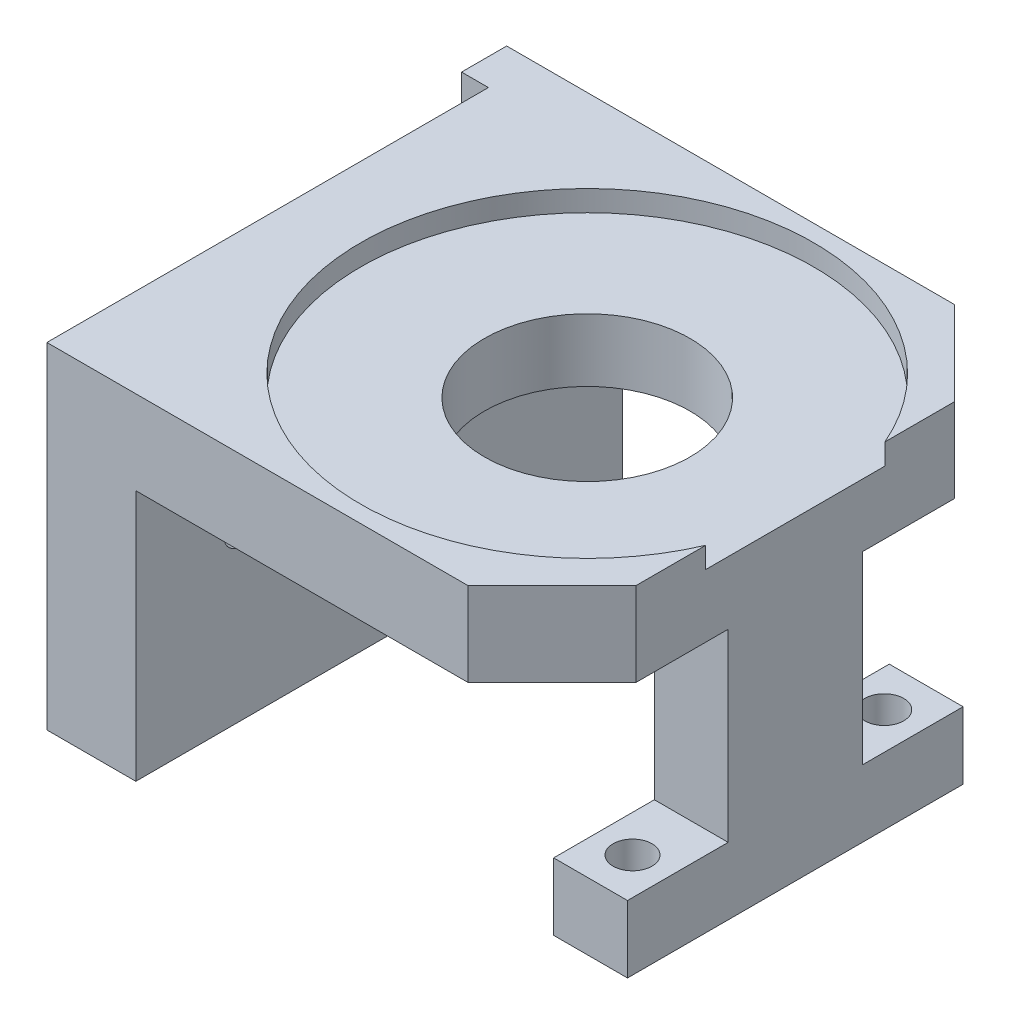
ISO-10303-21;
HEADER;
FILE_DESCRIPTION(('STEP AP214'),'2;1');
FILE_NAME('part.step','',(''),(''),'','','');
FILE_SCHEMA(('AUTOMOTIVE_DESIGN { 1 0 10303 214 1 1 1 1 }'));
ENDSEC;
DATA;
#1=APPLICATION_CONTEXT('core data for automotive mechanical design processes');
#2=APPLICATION_PROTOCOL_DEFINITION('international standard','automotive_design',2000,#1);
#3=PRODUCT_CONTEXT('',#1,'mechanical');
#4=PRODUCT('Part','Part','',(#3));
#5=PRODUCT_RELATED_PRODUCT_CATEGORY('part','',(#4));
#6=PRODUCT_DEFINITION_FORMATION('','',#4);
#7=PRODUCT_DEFINITION_CONTEXT('part definition',#1,'design');
#8=PRODUCT_DEFINITION('design','',#6,#7);
#9=PRODUCT_DEFINITION_SHAPE('','',#8);
#10=(LENGTH_UNIT() NAMED_UNIT(*) SI_UNIT(.MILLI.,.METRE.));
#11=(NAMED_UNIT(*) PLANE_ANGLE_UNIT() SI_UNIT($,.RADIAN.));
#12=(NAMED_UNIT(*) SI_UNIT($,.STERADIAN.) SOLID_ANGLE_UNIT());
#13=UNCERTAINTY_MEASURE_WITH_UNIT(LENGTH_MEASURE(1.E-05),#10,'distance_accuracy_value','');
#14=(GEOMETRIC_REPRESENTATION_CONTEXT(3) GLOBAL_UNCERTAINTY_ASSIGNED_CONTEXT((#13)) GLOBAL_UNIT_ASSIGNED_CONTEXT((#10,
#11,#12)) REPRESENTATION_CONTEXT('',''));
#15=CARTESIAN_POINT('',(0.,0.,0.));
#16=DIRECTION('',(0.,0.,1.));
#17=DIRECTION('',(1.,0.,0.));
#18=AXIS2_PLACEMENT_3D('',#15,#16,#17);
#19=CARTESIAN_POINT('',(0.,-6.35,0.));
#20=DIRECTION('',(0.,1.,0.));
#21=DIRECTION('',(0.,0.,1.));
#22=AXIS2_PLACEMENT_3D('',#19,#20,#21);
#23=CYLINDRICAL_SURFACE('',#22,7.77875);
#24=CARTESIAN_POINT('',(0.,-6.35,0.));
#25=DIRECTION('',(0.,1.,0.));
#26=DIRECTION('',(0.,0.,1.));
#27=AXIS2_PLACEMENT_3D('',#24,#25,#26);
#28=CIRCLE('',#27,7.77875);
#29=CARTESIAN_POINT('',(0.,-6.35,7.77875));
#30=VERTEX_POINT('',#29);
#31=EDGE_CURVE('E331',#30,#30,#28,.T.);
#32=ORIENTED_EDGE('',*,*,#31,.F.);
#33=EDGE_LOOP('',(#32));
#34=FACE_BOUND('',#33,.T.);
#35=CARTESIAN_POINT('',(0.,-1.5875,0.));
#36=DIRECTION('',(0.,1.,0.));
#37=DIRECTION('',(0.,0.,1.));
#38=AXIS2_PLACEMENT_3D('',#35,#36,#37);
#39=CIRCLE('',#38,7.77875);
#40=CARTESIAN_POINT('',(0.,-1.5875,7.77875));
#41=VERTEX_POINT('',#40);
#42=EDGE_CURVE('E48',#41,#41,#39,.F.);
#43=ORIENTED_EDGE('',*,*,#42,.F.);
#44=EDGE_LOOP('',(#43));
#45=FACE_BOUND('',#44,.T.);
#46=ADVANCED_FACE('F44',(#34,#45),#23,.F.);
#47=CARTESIAN_POINT('',(0.,-6.35,0.));
#48=DIRECTION('',(0.,1.,0.));
#49=DIRECTION('',(0.,0.,1.));
#50=AXIS2_PLACEMENT_3D('',#47,#48,#49);
#51=PLANE('',#50);
#52=ORIENTED_EDGE('',*,*,#31,.T.);
#53=EDGE_LOOP('',(#52));
#54=FACE_BOUND('',#53,.T.);
#55=DIRECTION('',(-1.,0.,0.));
#56=VECTOR('',#55,1.);
#57=CARTESIAN_POINT('',(-22.479,-6.35,-18.415));
#58=LINE('',#57,#56);
#59=CARTESIAN_POINT('',(9.39799999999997,-6.35,-18.415));
#60=VERTEX_POINT('',#59);
#61=CARTESIAN_POINT('',(-15.748,-6.35,-18.415));
#62=VERTEX_POINT('',#61);
#63=EDGE_CURVE('E257',#60,#62,#58,.T.);
#64=ORIENTED_EDGE('',*,*,#63,.F.);
#65=DIRECTION('',(-0.707106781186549,0.,-0.707106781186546));
#66=VECTOR('',#65,1.);
#67=CARTESIAN_POINT('',(15.748,-6.35,-12.065));
#68=LINE('',#67,#66);
#69=CARTESIAN_POINT('',(15.748,-6.35,-12.065));
#70=VERTEX_POINT('',#69);
#71=EDGE_CURVE('E54',#60,#70,#68,.F.);
#72=ORIENTED_EDGE('',*,*,#71,.T.);
#73=DIRECTION('',(0.,0.,-1.));
#74=VECTOR('',#73,1.);
#75=CARTESIAN_POINT('',(15.748,-6.35,-18.415));
#76=LINE('',#75,#74);
#77=CARTESIAN_POINT('',(15.748,-6.35,-5.08));
#78=VERTEX_POINT('',#77);
#79=EDGE_CURVE('E261',#78,#70,#76,.T.);
#80=ORIENTED_EDGE('',*,*,#79,.F.);
#81=DIRECTION('',(1.,0.,0.));
#82=VECTOR('',#81,1.);
#83=CARTESIAN_POINT('',(15.748,-6.35,-5.08));
#84=LINE('',#83,#82);
#85=CARTESIAN_POINT('',(10.16,-6.35,-5.08));
#86=VERTEX_POINT('',#85);
#87=EDGE_CURVE('E388',#86,#78,#84,.T.);
#88=ORIENTED_EDGE('',*,*,#87,.F.);
#89=DIRECTION('',(0.,0.,-1.));
#90=VECTOR('',#89,1.);
#91=CARTESIAN_POINT('',(10.16,-6.35,-5.08));
#92=LINE('',#91,#90);
#93=CARTESIAN_POINT('',(10.16,-6.35,5.08));
#94=VERTEX_POINT('',#93);
#95=EDGE_CURVE('E394',#94,#86,#92,.T.);
#96=ORIENTED_EDGE('',*,*,#95,.F.);
#97=DIRECTION('',(-1.,0.,0.));
#98=VECTOR('',#97,1.);
#99=CARTESIAN_POINT('',(15.748,-6.35,5.08));
#100=LINE('',#99,#98);
#101=CARTESIAN_POINT('',(15.748,-6.35,5.08));
#102=VERTEX_POINT('',#101);
#103=EDGE_CURVE('E383',#102,#94,#100,.T.);
#104=ORIENTED_EDGE('',*,*,#103,.F.);
#105=CARTESIAN_POINT('',(15.748,-6.35,12.065));
#106=VERTEX_POINT('',#105);
#107=EDGE_CURVE('E269',#106,#102,#76,.T.);
#108=ORIENTED_EDGE('',*,*,#107,.F.);
#109=DIRECTION('',(0.707106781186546,0.,-0.707106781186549));
#110=VECTOR('',#109,1.);
#111=CARTESIAN_POINT('',(9.398,-6.35,18.415));
#112=LINE('',#111,#110);
#113=CARTESIAN_POINT('',(9.398,-6.35,18.415));
#114=VERTEX_POINT('',#113);
#115=EDGE_CURVE('E74',#106,#114,#112,.F.);
#116=ORIENTED_EDGE('',*,*,#115,.T.);
#117=DIRECTION('',(1.,0.,0.));
#118=VECTOR('',#117,1.);
#119=CARTESIAN_POINT('',(-22.479,-6.35,18.415));
#120=LINE('',#119,#118);
#121=CARTESIAN_POINT('',(-15.748,-6.35,18.415));
#122=VERTEX_POINT('',#121);
#123=EDGE_CURVE('E245',#122,#114,#120,.T.);
#124=ORIENTED_EDGE('',*,*,#123,.F.);
#125=DIRECTION('',(0.,0.,1.));
#126=VECTOR('',#125,1.);
#127=CARTESIAN_POINT('',(-15.748,-6.35,18.415));
#128=LINE('',#127,#126);
#129=EDGE_CURVE('E262',#62,#122,#128,.T.);
#130=ORIENTED_EDGE('',*,*,#129,.F.);
#131=EDGE_LOOP('',(#64,#72,#80,#88,#96,#104,#108,#116,#124,#130));
#132=FACE_BOUND('',#131,.T.);
#133=ADVANCED_FACE('F292',(#54,#132),#51,.F.);
#134=CARTESIAN_POINT('',(-22.479,-6.35,-18.415));
#135=DIRECTION('',(-1.,0.,0.));
#136=DIRECTION('',(0.,0.,1.));
#137=AXIS2_PLACEMENT_3D('',#134,#135,#136);
#138=PLANE('',#137);
#139=CARTESIAN_POINT('',(-22.479,-12.7,10.5));
#140=DIRECTION('',(-1.,0.,0.));
#141=DIRECTION('',(0.,0.,1.));
#142=AXIS2_PLACEMENT_3D('',#139,#140,#141);
#143=CIRCLE('',#142,1.25);
#144=CARTESIAN_POINT('',(-22.479,-12.7,11.75));
#145=VERTEX_POINT('',#144);
#146=EDGE_CURVE('E546',#145,#145,#143,.T.);
#147=ORIENTED_EDGE('',*,*,#146,.F.);
#148=EDGE_LOOP('',(#147));
#149=FACE_BOUND('',#148,.T.);
#150=CARTESIAN_POINT('',(-22.479,-12.7,-10.5));
#151=DIRECTION('',(-1.,0.,0.));
#152=DIRECTION('',(0.,0.,1.));
#153=AXIS2_PLACEMENT_3D('',#150,#151,#152);
#154=CIRCLE('',#153,1.25);
#155=CARTESIAN_POINT('',(-22.479,-12.7,-9.25));
#156=VERTEX_POINT('',#155);
#157=EDGE_CURVE('E540',#156,#156,#154,.T.);
#158=ORIENTED_EDGE('',*,*,#157,.F.);
#159=EDGE_LOOP('',(#158));
#160=FACE_BOUND('',#159,.T.);
#161=DIRECTION('',(0.,1.,0.));
#162=VECTOR('',#161,1.);
#163=CARTESIAN_POINT('',(-22.479,0.,-14.999999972));
#164=LINE('',#163,#162);
#165=CARTESIAN_POINT('',(-22.479,-25.4,-14.999999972));
#166=VERTEX_POINT('',#165);
#167=CARTESIAN_POINT('',(-22.479,0.,-14.999999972));
#168=VERTEX_POINT('',#167);
#169=EDGE_CURVE('E325',#166,#168,#164,.T.);
#170=ORIENTED_EDGE('',*,*,#169,.F.);
#171=DIRECTION('',(0.,0.,-1.));
#172=VECTOR('',#171,1.);
#173=CARTESIAN_POINT('',(-22.479,-25.4,18.415));
#174=LINE('',#173,#172);
#175=CARTESIAN_POINT('',(-22.479,-25.4,18.415));
#176=VERTEX_POINT('',#175);
#177=EDGE_CURVE('E332',#176,#166,#174,.T.);
#178=ORIENTED_EDGE('',*,*,#177,.F.);
#179=DIRECTION('',(0.,1.,0.));
#180=VECTOR('',#179,1.);
#181=CARTESIAN_POINT('',(-22.479,-6.35,18.415));
#182=LINE('',#181,#180);
#183=CARTESIAN_POINT('',(-22.479,0.,18.415));
#184=VERTEX_POINT('',#183);
#185=EDGE_CURVE('E252',#176,#184,#182,.T.);
#186=ORIENTED_EDGE('',*,*,#185,.T.);
#187=DIRECTION('',(0.,0.,1.));
#188=VECTOR('',#187,1.);
#189=CARTESIAN_POINT('',(-22.479,0.,-18.415));
#190=LINE('',#189,#188);
#191=EDGE_CURVE('E435',#168,#184,#190,.T.);
#192=ORIENTED_EDGE('',*,*,#191,.F.);
#193=EDGE_LOOP('',(#170,#178,#186,#192));
#194=FACE_BOUND('',#193,.T.);
#195=ADVANCED_FACE('F584',(#149,#160,#194),#138,.T.);
#196=CARTESIAN_POINT('',(-22.479,-6.35,-18.415));
#197=DIRECTION('',(0.,0.,-1.));
#198=DIRECTION('',(-1.,0.,0.));
#199=AXIS2_PLACEMENT_3D('',#196,#197,#198);
#200=PLANE('',#199);
#201=CARTESIAN_POINT('',(-19.4246502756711,-3.175,-18.415));
#202=DIRECTION('',(0.,0.,-1.));
#203=DIRECTION('',(-1.,0.,0.));
#204=AXIS2_PLACEMENT_3D('',#201,#202,#203);
#205=CIRCLE('',#204,1.7272);
#206=CARTESIAN_POINT('',(-21.1518502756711,-3.175,-18.415));
#207=VERTEX_POINT('',#206);
#208=EDGE_CURVE('E537',#207,#207,#205,.T.);
#209=ORIENTED_EDGE('',*,*,#208,.F.);
#210=EDGE_LOOP('',(#209));
#211=FACE_BOUND('',#210,.T.);
#212=CARTESIAN_POINT('',(-19.4246502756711,-22.225,-18.415));
#213=DIRECTION('',(0.,0.,-1.));
#214=DIRECTION('',(-1.,0.,0.));
#215=AXIS2_PLACEMENT_3D('',#212,#213,#214);
#216=CIRCLE('',#215,1.7272);
#217=CARTESIAN_POINT('',(-21.1518502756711,-22.225,-18.415));
#218=VERTEX_POINT('',#217);
#219=EDGE_CURVE('E530',#218,#218,#216,.T.);
#220=ORIENTED_EDGE('',*,*,#219,.F.);
#221=EDGE_LOOP('',(#220));
#222=FACE_BOUND('',#221,.T.);
#223=DIRECTION('',(-1.,0.,0.));
#224=VECTOR('',#223,1.);
#225=CARTESIAN_POINT('',(-22.479,0.,-18.415));
#226=LINE('',#225,#224);
#227=CARTESIAN_POINT('',(9.39799999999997,0.,-18.415));
#228=VERTEX_POINT('',#227);
#229=CARTESIAN_POINT('',(-24.511,0.,-18.415));
#230=VERTEX_POINT('',#229);
#231=EDGE_CURVE('E240',#228,#230,#226,.T.);
#232=ORIENTED_EDGE('',*,*,#231,.F.);
#233=DIRECTION('',(0.,-1.,0.));
#234=VECTOR('',#233,1.);
#235=CARTESIAN_POINT('',(9.39799999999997,-6.35,-18.415));
#236=LINE('',#235,#234);
#237=EDGE_CURVE('E280',#228,#60,#236,.T.);
#238=ORIENTED_EDGE('',*,*,#237,.T.);
#239=ORIENTED_EDGE('',*,*,#63,.T.);
#240=DIRECTION('',(0.,1.,0.));
#241=VECTOR('',#240,1.);
#242=CARTESIAN_POINT('',(-15.748,-25.4,-18.415));
#243=LINE('',#242,#241);
#244=CARTESIAN_POINT('',(-15.748,-25.4,-18.415));
#245=VERTEX_POINT('',#244);
#246=EDGE_CURVE('E429',#245,#62,#243,.T.);
#247=ORIENTED_EDGE('',*,*,#246,.F.);
#248=DIRECTION('',(1.,0.,0.));
#249=VECTOR('',#248,1.);
#250=CARTESIAN_POINT('',(-22.479,-25.4,-18.415));
#251=LINE('',#250,#249);
#252=CARTESIAN_POINT('',(-24.511,-25.4,-18.415));
#253=VERTEX_POINT('',#252);
#254=EDGE_CURVE('E413',#253,#245,#251,.T.);
#255=ORIENTED_EDGE('',*,*,#254,.F.);
#256=DIRECTION('',(0.,-1.,0.));
#257=VECTOR('',#256,1.);
#258=CARTESIAN_POINT('',(-24.511,0.,-18.415));
#259=LINE('',#258,#257);
#260=EDGE_CURVE('E330',#230,#253,#259,.T.);
#261=ORIENTED_EDGE('',*,*,#260,.F.);
#262=EDGE_LOOP('',(#232,#238,#239,#247,#255,#261));
#263=FACE_BOUND('',#262,.T.);
#264=ADVANCED_FACE('F505',(#211,#222,#263),#200,.T.);
#265=CARTESIAN_POINT('',(15.748,-6.35,-18.415));
#266=DIRECTION('',(1.,0.,0.));
#267=DIRECTION('',(0.,0.,-1.));
#268=AXIS2_PLACEMENT_3D('',#265,#266,#267);
#269=PLANE('',#268);
#270=DIRECTION('',(0.,1.,0.));
#271=VECTOR('',#270,1.);
#272=CARTESIAN_POINT('',(15.748,-1.5875,-6.77875512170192));
#273=LINE('',#272,#271);
#274=CARTESIAN_POINT('',(15.748,-1.5875,-6.77875512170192));
#275=VERTEX_POINT('',#274);
#276=CARTESIAN_POINT('',(15.748,0.,-6.77875512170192));
#277=VERTEX_POINT('',#276);
#278=EDGE_CURVE('E63',#275,#277,#273,.T.);
#279=ORIENTED_EDGE('',*,*,#278,.F.);
#280=DIRECTION('',(0.,0.,1.));
#281=VECTOR('',#280,1.);
#282=CARTESIAN_POINT('',(15.748,-1.5875,-18.415));
#283=LINE('',#282,#281);
#284=CARTESIAN_POINT('',(15.748,-1.5875,6.77875512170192));
#285=VERTEX_POINT('',#284);
#286=EDGE_CURVE('E233',#275,#285,#283,.T.);
#287=ORIENTED_EDGE('',*,*,#286,.T.);
#288=DIRECTION('',(0.,1.,0.));
#289=VECTOR('',#288,1.);
#290=CARTESIAN_POINT('',(15.748,-1.5875,6.77875512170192));
#291=LINE('',#290,#289);
#292=CARTESIAN_POINT('',(15.748,0.,6.77875512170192));
#293=VERTEX_POINT('',#292);
#294=EDGE_CURVE('E219',#293,#285,#291,.F.);
#295=ORIENTED_EDGE('',*,*,#294,.F.);
#296=DIRECTION('',(0.,0.,-1.));
#297=VECTOR('',#296,1.);
#298=CARTESIAN_POINT('',(15.748,0.,-18.415));
#299=LINE('',#298,#297);
#300=CARTESIAN_POINT('',(15.748,0.,12.065));
#301=VERTEX_POINT('',#300);
#302=EDGE_CURVE('E231',#301,#293,#299,.T.);
#303=ORIENTED_EDGE('',*,*,#302,.F.);
#304=DIRECTION('',(0.,-1.,0.));
#305=VECTOR('',#304,1.);
#306=CARTESIAN_POINT('',(15.748,-6.35,12.065));
#307=LINE('',#306,#305);
#308=EDGE_CURVE('E307',#301,#106,#307,.T.);
#309=ORIENTED_EDGE('',*,*,#308,.T.);
#310=ORIENTED_EDGE('',*,*,#107,.T.);
#311=DIRECTION('',(0.,1.,0.));
#312=VECTOR('',#311,1.);
#313=CARTESIAN_POINT('',(15.748,-25.4,5.08));
#314=LINE('',#313,#312);
#315=CARTESIAN_POINT('',(15.748,-20.32,5.08));
#316=VERTEX_POINT('',#315);
#317=EDGE_CURVE('E408',#316,#102,#314,.T.);
#318=ORIENTED_EDGE('',*,*,#317,.F.);
#319=DIRECTION('',(0.,0.,1.));
#320=VECTOR('',#319,1.);
#321=CARTESIAN_POINT('',(15.748,-20.32,12.7));
#322=LINE('',#321,#320);
#323=CARTESIAN_POINT('',(15.748,-20.32,12.7));
#324=VERTEX_POINT('',#323);
#325=EDGE_CURVE('E343',#316,#324,#322,.T.);
#326=ORIENTED_EDGE('',*,*,#325,.T.);
#327=DIRECTION('',(0.,-1.,0.));
#328=VECTOR('',#327,1.);
#329=CARTESIAN_POINT('',(15.748,-20.32,12.7));
#330=LINE('',#329,#328);
#331=CARTESIAN_POINT('',(15.748,-25.4,12.7));
#332=VERTEX_POINT('',#331);
#333=EDGE_CURVE('E356',#324,#332,#330,.T.);
#334=ORIENTED_EDGE('',*,*,#333,.T.);
#335=DIRECTION('',(0.,0.,1.));
#336=VECTOR('',#335,1.);
#337=CARTESIAN_POINT('',(15.748,-25.4,-5.08));
#338=LINE('',#337,#336);
#339=CARTESIAN_POINT('',(15.748,-25.4,-12.7));
#340=VERTEX_POINT('',#339);
#341=EDGE_CURVE('E384',#340,#332,#338,.T.);
#342=ORIENTED_EDGE('',*,*,#341,.F.);
#343=DIRECTION('',(0.,-1.,0.));
#344=VECTOR('',#343,1.);
#345=CARTESIAN_POINT('',(15.748,-20.32,-12.7));
#346=LINE('',#345,#344);
#347=CARTESIAN_POINT('',(15.748,-20.32,-12.7));
#348=VERTEX_POINT('',#347);
#349=EDGE_CURVE('E364',#348,#340,#346,.T.);
#350=ORIENTED_EDGE('',*,*,#349,.F.);
#351=CARTESIAN_POINT('',(15.748,-20.32,-5.08));
#352=VERTEX_POINT('',#351);
#353=EDGE_CURVE('E339',#348,#352,#322,.T.);
#354=ORIENTED_EDGE('',*,*,#353,.T.);
#355=DIRECTION('',(0.,1.,0.));
#356=VECTOR('',#355,1.);
#357=CARTESIAN_POINT('',(15.748,-25.4,-5.08));
#358=LINE('',#357,#356);
#359=EDGE_CURVE('E302',#352,#78,#358,.T.);
#360=ORIENTED_EDGE('',*,*,#359,.T.);
#361=ORIENTED_EDGE('',*,*,#79,.T.);
#362=DIRECTION('',(0.,1.,0.));
#363=VECTOR('',#362,1.);
#364=CARTESIAN_POINT('',(15.748,-6.35,-12.065));
#365=LINE('',#364,#363);
#366=CARTESIAN_POINT('',(15.748,0.,-12.065));
#367=VERTEX_POINT('',#366);
#368=EDGE_CURVE('E299',#70,#367,#365,.T.);
#369=ORIENTED_EDGE('',*,*,#368,.T.);
#370=EDGE_CURVE('E241',#277,#367,#299,.T.);
#371=ORIENTED_EDGE('',*,*,#370,.F.);
#372=EDGE_LOOP('',(#279,#287,#295,#303,#309,#310,#318,#326,#334,#342,#350,#354,#360,#361,#369,#371));
#373=FACE_BOUND('',#372,.T.);
#374=ADVANCED_FACE('F230',(#373),#269,.T.);
#375=CARTESIAN_POINT('',(-22.479,-6.35,18.415));
#376=DIRECTION('',(0.,0.,1.));
#377=DIRECTION('',(1.,0.,0.));
#378=AXIS2_PLACEMENT_3D('',#375,#376,#377);
#379=PLANE('',#378);
#380=ORIENTED_EDGE('',*,*,#123,.T.);
#381=DIRECTION('',(0.,1.,0.));
#382=VECTOR('',#381,1.);
#383=CARTESIAN_POINT('',(9.398,-6.35,18.415));
#384=LINE('',#383,#382);
#385=CARTESIAN_POINT('',(9.39800000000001,0.,18.415));
#386=VERTEX_POINT('',#385);
#387=EDGE_CURVE('E11',#114,#386,#384,.T.);
#388=ORIENTED_EDGE('',*,*,#387,.T.);
#389=DIRECTION('',(1.,0.,0.));
#390=VECTOR('',#389,1.);
#391=CARTESIAN_POINT('',(-22.479,0.,18.415));
#392=LINE('',#391,#390);
#393=EDGE_CURVE('E248',#184,#386,#392,.T.);
#394=ORIENTED_EDGE('',*,*,#393,.F.);
#395=ORIENTED_EDGE('',*,*,#185,.F.);
#396=DIRECTION('',(-1.,0.,0.));
#397=VECTOR('',#396,1.);
#398=CARTESIAN_POINT('',(-22.479,-25.4,18.415));
#399=LINE('',#398,#397);
#400=CARTESIAN_POINT('',(-15.748,-25.4,18.415));
#401=VERTEX_POINT('',#400);
#402=EDGE_CURVE('E417',#401,#176,#399,.T.);
#403=ORIENTED_EDGE('',*,*,#402,.F.);
#404=DIRECTION('',(0.,1.,0.));
#405=VECTOR('',#404,1.);
#406=CARTESIAN_POINT('',(-15.748,-25.4,18.415));
#407=LINE('',#406,#405);
#408=EDGE_CURVE('E420',#401,#122,#407,.T.);
#409=ORIENTED_EDGE('',*,*,#408,.T.);
#410=EDGE_LOOP('',(#380,#388,#394,#395,#403,#409));
#411=FACE_BOUND('',#410,.T.);
#412=ADVANCED_FACE('F446',(#411),#379,.T.);
#413=CARTESIAN_POINT('',(0.,0.,0.));
#414=DIRECTION('',(0.,1.,0.));
#415=DIRECTION('',(0.,0.,1.));
#416=AXIS2_PLACEMENT_3D('',#413,#414,#415);
#417=PLANE('',#416);
#418=CARTESIAN_POINT('',(0.,0.,0.));
#419=DIRECTION('',(0.,1.,0.));
#420=DIRECTION('',(0.,0.,1.));
#421=AXIS2_PLACEMENT_3D('',#418,#419,#420);
#422=CIRCLE('',#421,17.145);
#423=EDGE_CURVE('E216',#277,#293,#422,.T.);
#424=ORIENTED_EDGE('',*,*,#423,.F.);
#425=ORIENTED_EDGE('',*,*,#370,.T.);
#426=DIRECTION('',(0.707106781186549,0.,0.707106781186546));
#427=VECTOR('',#426,1.);
#428=CARTESIAN_POINT('',(13.9065,0.,-13.9065));
#429=LINE('',#428,#427);
#430=EDGE_CURVE('E278',#367,#228,#429,.F.);
#431=ORIENTED_EDGE('',*,*,#430,.T.);
#432=ORIENTED_EDGE('',*,*,#231,.T.);
#433=DIRECTION('',(0.,0.,-1.));
#434=VECTOR('',#433,1.);
#435=CARTESIAN_POINT('',(-24.511,0.,-18.415));
#436=LINE('',#435,#434);
#437=CARTESIAN_POINT('',(-24.511,0.,-14.999999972));
#438=VERTEX_POINT('',#437);
#439=EDGE_CURVE('E324',#438,#230,#436,.T.);
#440=ORIENTED_EDGE('',*,*,#439,.F.);
#441=DIRECTION('',(1.,0.,0.));
#442=VECTOR('',#441,1.);
#443=CARTESIAN_POINT('',(-24.511,0.,-14.999999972));
#444=LINE('',#443,#442);
#445=EDGE_CURVE('E318',#438,#168,#444,.T.);
#446=ORIENTED_EDGE('',*,*,#445,.T.);
#447=ORIENTED_EDGE('',*,*,#191,.T.);
#448=ORIENTED_EDGE('',*,*,#393,.T.);
#449=DIRECTION('',(-0.707106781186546,0.,0.707106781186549));
#450=VECTOR('',#449,1.);
#451=CARTESIAN_POINT('',(13.9065,0.,13.9065));
#452=LINE('',#451,#450);
#453=EDGE_CURVE('E238',#386,#301,#452,.F.);
#454=ORIENTED_EDGE('',*,*,#453,.T.);
#455=ORIENTED_EDGE('',*,*,#302,.T.);
#456=EDGE_LOOP('',(#424,#425,#431,#432,#440,#446,#447,#448,#454,#455));
#457=FACE_BOUND('',#456,.T.);
#458=ADVANCED_FACE('F236',(#457),#417,.T.);
#459=CARTESIAN_POINT('',(-15.748,-25.4,18.415));
#460=DIRECTION('',(-1.,0.,0.));
#461=DIRECTION('',(0.,0.,1.));
#462=AXIS2_PLACEMENT_3D('',#459,#460,#461);
#463=PLANE('',#462);
#464=CARTESIAN_POINT('',(-15.748,-12.7,10.5));
#465=DIRECTION('',(1.,0.,0.));
#466=DIRECTION('',(0.,0.,-1.));
#467=AXIS2_PLACEMENT_3D('',#464,#465,#466);
#468=CIRCLE('',#467,1.25);
#469=CARTESIAN_POINT('',(-15.748,-12.7,9.25));
#470=VERTEX_POINT('',#469);
#471=EDGE_CURVE('E549',#470,#470,#468,.T.);
#472=ORIENTED_EDGE('',*,*,#471,.F.);
#473=EDGE_LOOP('',(#472));
#474=FACE_BOUND('',#473,.T.);
#475=CARTESIAN_POINT('',(-15.748,-12.7,-10.5));
#476=DIRECTION('',(1.,0.,0.));
#477=DIRECTION('',(0.,0.,-1.));
#478=AXIS2_PLACEMENT_3D('',#475,#476,#477);
#479=CIRCLE('',#478,1.25);
#480=CARTESIAN_POINT('',(-15.748,-12.7,-11.75));
#481=VERTEX_POINT('',#480);
#482=EDGE_CURVE('E543',#481,#481,#479,.T.);
#483=ORIENTED_EDGE('',*,*,#482,.F.);
#484=EDGE_LOOP('',(#483));
#485=FACE_BOUND('',#484,.T.);
#486=ORIENTED_EDGE('',*,*,#129,.T.);
#487=ORIENTED_EDGE('',*,*,#408,.F.);
#488=DIRECTION('',(0.,0.,1.));
#489=VECTOR('',#488,1.);
#490=CARTESIAN_POINT('',(-15.748,-25.4,18.415));
#491=LINE('',#490,#489);
#492=EDGE_CURVE('E415',#245,#401,#491,.T.);
#493=ORIENTED_EDGE('',*,*,#492,.F.);
#494=ORIENTED_EDGE('',*,*,#246,.T.);
#495=EDGE_LOOP('',(#486,#487,#493,#494));
#496=FACE_BOUND('',#495,.T.);
#497=ADVANCED_FACE('F500',(#474,#485,#496),#463,.F.);
#498=CARTESIAN_POINT('',(0.,-25.4,0.));
#499=DIRECTION('',(0.,-1.,0.));
#500=DIRECTION('',(0.,0.,-1.));
#501=AXIS2_PLACEMENT_3D('',#498,#499,#500);
#502=PLANE('',#501);
#503=CARTESIAN_POINT('',(-19.1135,-25.4,6.985));
#504=DIRECTION('',(0.,-1.,0.));
#505=DIRECTION('',(0.,0.,-1.));
#506=AXIS2_PLACEMENT_3D('',#503,#504,#505);
#507=CIRCLE('',#506,1.1303);
#508=CARTESIAN_POINT('',(-19.1135,-25.4,5.8547));
#509=VERTEX_POINT('',#508);
#510=EDGE_CURVE('E492',#509,#509,#507,.T.);
#511=ORIENTED_EDGE('',*,*,#510,.F.);
#512=EDGE_LOOP('',(#511));
#513=FACE_BOUND('',#512,.T.);
#514=CARTESIAN_POINT('',(-19.1135,-25.4,-6.985));
#515=DIRECTION('',(0.,-1.,0.));
#516=DIRECTION('',(0.,0.,-1.));
#517=AXIS2_PLACEMENT_3D('',#514,#515,#516);
#518=CIRCLE('',#517,1.1303);
#519=CARTESIAN_POINT('',(-19.1135,-25.4,-8.1153));
#520=VERTEX_POINT('',#519);
#521=EDGE_CURVE('E561',#520,#520,#518,.T.);
#522=ORIENTED_EDGE('',*,*,#521,.F.);
#523=EDGE_LOOP('',(#522));
#524=FACE_BOUND('',#523,.T.);
#525=ORIENTED_EDGE('',*,*,#177,.T.);
#526=DIRECTION('',(1.,0.,0.));
#527=VECTOR('',#526,1.);
#528=CARTESIAN_POINT('',(-24.511,-25.4,-14.999999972));
#529=LINE('',#528,#527);
#530=CARTESIAN_POINT('',(-24.511,-25.4,-14.999999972));
#531=VERTEX_POINT('',#530);
#532=EDGE_CURVE('E314',#531,#166,#529,.T.);
#533=ORIENTED_EDGE('',*,*,#532,.F.);
#534=DIRECTION('',(0.,0.,1.));
#535=VECTOR('',#534,1.);
#536=CARTESIAN_POINT('',(-24.511,-25.4,-18.415));
#537=LINE('',#536,#535);
#538=EDGE_CURVE('E518',#253,#531,#537,.T.);
#539=ORIENTED_EDGE('',*,*,#538,.F.);
#540=ORIENTED_EDGE('',*,*,#254,.T.);
#541=ORIENTED_EDGE('',*,*,#492,.T.);
#542=ORIENTED_EDGE('',*,*,#402,.T.);
#543=EDGE_LOOP('',(#525,#533,#539,#540,#541,#542));
#544=FACE_BOUND('',#543,.T.);
#545=ADVANCED_FACE('F614',(#513,#524,#544),#502,.T.);
#546=CARTESIAN_POINT('',(15.748,-25.4,5.08));
#547=DIRECTION('',(0.,0.,-1.));
#548=DIRECTION('',(-1.,0.,0.));
#549=AXIS2_PLACEMENT_3D('',#546,#547,#548);
#550=PLANE('',#549);
#551=DIRECTION('',(0.,1.,0.));
#552=VECTOR('',#551,1.);
#553=CARTESIAN_POINT('',(10.16,-25.4,5.08));
#554=LINE('',#553,#552);
#555=CARTESIAN_POINT('',(10.16,-20.32,5.08));
#556=VERTEX_POINT('',#555);
#557=EDGE_CURVE('E405',#556,#94,#554,.T.);
#558=ORIENTED_EDGE('',*,*,#557,.F.);
#559=DIRECTION('',(1.,0.,0.));
#560=VECTOR('',#559,1.);
#561=CARTESIAN_POINT('',(15.748,-20.32,5.08));
#562=LINE('',#561,#560);
#563=EDGE_CURVE('E368',#556,#316,#562,.T.);
#564=ORIENTED_EDGE('',*,*,#563,.T.);
#565=ORIENTED_EDGE('',*,*,#317,.T.);
#566=ORIENTED_EDGE('',*,*,#103,.T.);
#567=EDGE_LOOP('',(#558,#564,#565,#566));
#568=FACE_BOUND('',#567,.T.);
#569=ADVANCED_FACE('F454',(#568),#550,.F.);
#570=CARTESIAN_POINT('',(10.16,-25.4,-5.08));
#571=DIRECTION('',(1.,0.,0.));
#572=DIRECTION('',(0.,0.,-1.));
#573=AXIS2_PLACEMENT_3D('',#570,#571,#572);
#574=PLANE('',#573);
#575=DIRECTION('',(0.,1.,0.));
#576=VECTOR('',#575,1.);
#577=CARTESIAN_POINT('',(10.16,-25.4,-5.08));
#578=LINE('',#577,#576);
#579=CARTESIAN_POINT('',(10.16,-20.32,-5.08));
#580=VERTEX_POINT('',#579);
#581=EDGE_CURVE('E402',#580,#86,#578,.T.);
#582=ORIENTED_EDGE('',*,*,#581,.F.);
#583=DIRECTION('',(0.,0.,-1.));
#584=VECTOR('',#583,1.);
#585=CARTESIAN_POINT('',(10.16,-20.32,12.7));
#586=LINE('',#585,#584);
#587=CARTESIAN_POINT('',(10.16,-20.32,-12.7));
#588=VERTEX_POINT('',#587);
#589=EDGE_CURVE('E347',#580,#588,#586,.T.);
#590=ORIENTED_EDGE('',*,*,#589,.T.);
#591=DIRECTION('',(0.,-1.,0.));
#592=VECTOR('',#591,1.);
#593=CARTESIAN_POINT('',(10.16,-20.32,-12.7));
#594=LINE('',#593,#592);
#595=CARTESIAN_POINT('',(10.16,-25.4,-12.7));
#596=VERTEX_POINT('',#595);
#597=EDGE_CURVE('E369',#588,#596,#594,.T.);
#598=ORIENTED_EDGE('',*,*,#597,.T.);
#599=DIRECTION('',(0.,0.,-1.));
#600=VECTOR('',#599,1.);
#601=CARTESIAN_POINT('',(10.16,-25.4,-5.08));
#602=LINE('',#601,#600);
#603=CARTESIAN_POINT('',(10.16,-25.4,12.7));
#604=VERTEX_POINT('',#603);
#605=EDGE_CURVE('E387',#604,#596,#602,.T.);
#606=ORIENTED_EDGE('',*,*,#605,.F.);
#607=DIRECTION('',(0.,-1.,0.));
#608=VECTOR('',#607,1.);
#609=CARTESIAN_POINT('',(10.16,-20.32,12.7));
#610=LINE('',#609,#608);
#611=CARTESIAN_POINT('',(10.16,-20.32,12.7));
#612=VERTEX_POINT('',#611);
#613=EDGE_CURVE('E373',#612,#604,#610,.T.);
#614=ORIENTED_EDGE('',*,*,#613,.F.);
#615=EDGE_CURVE('E348',#612,#556,#586,.T.);
#616=ORIENTED_EDGE('',*,*,#615,.T.);
#617=ORIENTED_EDGE('',*,*,#557,.T.);
#618=ORIENTED_EDGE('',*,*,#95,.T.);
#619=EDGE_LOOP('',(#582,#590,#598,#606,#614,#616,#617,#618));
#620=FACE_BOUND('',#619,.T.);
#621=ADVANCED_FACE('F466',(#620),#574,.F.);
#622=CARTESIAN_POINT('',(15.748,-25.4,-5.08));
#623=DIRECTION('',(0.,0.,1.));
#624=DIRECTION('',(1.,0.,0.));
#625=AXIS2_PLACEMENT_3D('',#622,#623,#624);
#626=PLANE('',#625);
#627=ORIENTED_EDGE('',*,*,#359,.F.);
#628=DIRECTION('',(-1.,0.,0.));
#629=VECTOR('',#628,1.);
#630=CARTESIAN_POINT('',(15.748,-20.32,-5.08));
#631=LINE('',#630,#629);
#632=EDGE_CURVE('E256',#352,#580,#631,.T.);
#633=ORIENTED_EDGE('',*,*,#632,.T.);
#634=ORIENTED_EDGE('',*,*,#581,.T.);
#635=ORIENTED_EDGE('',*,*,#87,.T.);
#636=EDGE_LOOP('',(#627,#633,#634,#635));
#637=FACE_BOUND('',#636,.T.);
#638=ADVANCED_FACE('F478',(#637),#626,.F.);
#639=CARTESIAN_POINT('',(0.,-25.4,0.));
#640=DIRECTION('',(0.,-1.,0.));
#641=DIRECTION('',(0.,0.,-1.));
#642=AXIS2_PLACEMENT_3D('',#639,#640,#641);
#643=PLANE('',#642);
#644=CARTESIAN_POINT('',(12.954,-25.4,9.525));
#645=DIRECTION('',(0.,-1.,0.));
#646=DIRECTION('',(0.,0.,-1.));
#647=AXIS2_PLACEMENT_3D('',#644,#645,#646);
#648=CIRCLE('',#647,1.4732);
#649=CARTESIAN_POINT('',(12.954,-25.4,8.0518));
#650=VERTEX_POINT('',#649);
#651=EDGE_CURVE('E489',#650,#650,#648,.T.);
#652=ORIENTED_EDGE('',*,*,#651,.F.);
#653=EDGE_LOOP('',(#652));
#654=FACE_BOUND('',#653,.T.);
#655=CARTESIAN_POINT('',(12.954,-25.4,-9.525));
#656=DIRECTION('',(0.,-1.,0.));
#657=DIRECTION('',(0.,0.,-1.));
#658=AXIS2_PLACEMENT_3D('',#655,#656,#657);
#659=CIRCLE('',#658,1.4732);
#660=CARTESIAN_POINT('',(12.954,-25.4,-10.9982));
#661=VERTEX_POINT('',#660);
#662=EDGE_CURVE('E483',#661,#661,#659,.T.);
#663=ORIENTED_EDGE('',*,*,#662,.F.);
#664=EDGE_LOOP('',(#663));
#665=FACE_BOUND('',#664,.T.);
#666=ORIENTED_EDGE('',*,*,#341,.T.);
#667=DIRECTION('',(-1.,0.,0.));
#668=VECTOR('',#667,1.);
#669=CARTESIAN_POINT('',(15.748,-25.4,12.7));
#670=LINE('',#669,#668);
#671=EDGE_CURVE('E317',#332,#604,#670,.T.);
#672=ORIENTED_EDGE('',*,*,#671,.T.);
#673=ORIENTED_EDGE('',*,*,#605,.T.);
#674=DIRECTION('',(1.,0.,0.));
#675=VECTOR('',#674,1.);
#676=CARTESIAN_POINT('',(15.748,-25.4,-12.7));
#677=LINE('',#676,#675);
#678=EDGE_CURVE('E360',#596,#340,#677,.T.);
#679=ORIENTED_EDGE('',*,*,#678,.T.);
#680=EDGE_LOOP('',(#666,#672,#673,#679));
#681=FACE_BOUND('',#680,.T.);
#682=ADVANCED_FACE('F468',(#654,#665,#681),#643,.T.);
#683=CARTESIAN_POINT('',(15.748,-20.32,-12.7));
#684=DIRECTION('',(0.,0.,-1.));
#685=DIRECTION('',(-1.,0.,0.));
#686=AXIS2_PLACEMENT_3D('',#683,#684,#685);
#687=PLANE('',#686);
#688=ORIENTED_EDGE('',*,*,#678,.F.);
#689=ORIENTED_EDGE('',*,*,#597,.F.);
#690=DIRECTION('',(1.,0.,0.));
#691=VECTOR('',#690,1.);
#692=CARTESIAN_POINT('',(15.748,-20.32,-12.7));
#693=LINE('',#692,#691);
#694=EDGE_CURVE('E352',#588,#348,#693,.T.);
#695=ORIENTED_EDGE('',*,*,#694,.T.);
#696=ORIENTED_EDGE('',*,*,#349,.T.);
#697=EDGE_LOOP('',(#688,#689,#695,#696));
#698=FACE_BOUND('',#697,.T.);
#699=ADVANCED_FACE('F472',(#698),#687,.T.);
#700=CARTESIAN_POINT('',(0.,-20.32,0.));
#701=DIRECTION('',(0.,1.,0.));
#702=DIRECTION('',(0.,0.,1.));
#703=AXIS2_PLACEMENT_3D('',#700,#701,#702);
#704=PLANE('',#703);
#705=CARTESIAN_POINT('',(12.954,-20.32,-9.525));
#706=DIRECTION('',(0.,1.,0.));
#707=DIRECTION('',(0.,0.,1.));
#708=AXIS2_PLACEMENT_3D('',#705,#706,#707);
#709=CIRCLE('',#708,1.4732);
#710=CARTESIAN_POINT('',(12.954,-20.32,-8.0518));
#711=VERTEX_POINT('',#710);
#712=EDGE_CURVE('E481',#711,#711,#709,.T.);
#713=ORIENTED_EDGE('',*,*,#712,.F.);
#714=EDGE_LOOP('',(#713));
#715=FACE_BOUND('',#714,.T.);
#716=ORIENTED_EDGE('',*,*,#632,.F.);
#717=ORIENTED_EDGE('',*,*,#353,.F.);
#718=ORIENTED_EDGE('',*,*,#694,.F.);
#719=ORIENTED_EDGE('',*,*,#589,.F.);
#720=EDGE_LOOP('',(#716,#717,#718,#719));
#721=FACE_BOUND('',#720,.T.);
#722=ADVANCED_FACE('F476',(#715,#721),#704,.T.);
#723=CARTESIAN_POINT('',(12.954,-20.32,9.525));
#724=DIRECTION('',(0.,1.,0.));
#725=DIRECTION('',(0.,0.,1.));
#726=AXIS2_PLACEMENT_3D('',#723,#724,#725);
#727=CIRCLE('',#726,1.4732);
#728=CARTESIAN_POINT('',(12.954,-20.32,10.9982));
#729=VERTEX_POINT('',#728);
#730=EDGE_CURVE('E485',#729,#729,#727,.T.);
#731=ORIENTED_EDGE('',*,*,#730,.F.);
#732=EDGE_LOOP('',(#731));
#733=FACE_BOUND('',#732,.T.);
#734=ORIENTED_EDGE('',*,*,#563,.F.);
#735=ORIENTED_EDGE('',*,*,#615,.F.);
#736=DIRECTION('',(-1.,0.,0.));
#737=VECTOR('',#736,1.);
#738=CARTESIAN_POINT('',(15.748,-20.32,12.7));
#739=LINE('',#738,#737);
#740=EDGE_CURVE('E342',#324,#612,#739,.T.);
#741=ORIENTED_EDGE('',*,*,#740,.F.);
#742=ORIENTED_EDGE('',*,*,#325,.F.);
#743=EDGE_LOOP('',(#734,#735,#741,#742));
#744=FACE_BOUND('',#743,.T.);
#745=ADVANCED_FACE('F463',(#733,#744),#704,.T.);
#746=CARTESIAN_POINT('',(15.748,-20.32,12.7));
#747=DIRECTION('',(0.,0.,1.));
#748=DIRECTION('',(1.,0.,0.));
#749=AXIS2_PLACEMENT_3D('',#746,#747,#748);
#750=PLANE('',#749);
#751=ORIENTED_EDGE('',*,*,#671,.F.);
#752=ORIENTED_EDGE('',*,*,#333,.F.);
#753=ORIENTED_EDGE('',*,*,#740,.T.);
#754=ORIENTED_EDGE('',*,*,#613,.T.);
#755=EDGE_LOOP('',(#751,#752,#753,#754));
#756=FACE_BOUND('',#755,.T.);
#757=ADVANCED_FACE('F461',(#756),#750,.T.);
#758=CARTESIAN_POINT('',(-24.511,0.,-14.999999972));
#759=DIRECTION('',(0.,0.,-1.));
#760=DIRECTION('',(-1.,0.,0.));
#761=AXIS2_PLACEMENT_3D('',#758,#759,#760);
#762=PLANE('',#761);
#763=ORIENTED_EDGE('',*,*,#169,.T.);
#764=ORIENTED_EDGE('',*,*,#445,.F.);
#765=DIRECTION('',(0.,1.,0.));
#766=VECTOR('',#765,1.);
#767=CARTESIAN_POINT('',(-24.511,0.,-14.999999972));
#768=LINE('',#767,#766);
#769=EDGE_CURVE('E514',#531,#438,#768,.T.);
#770=ORIENTED_EDGE('',*,*,#769,.F.);
#771=ORIENTED_EDGE('',*,*,#532,.T.);
#772=EDGE_LOOP('',(#763,#764,#770,#771));
#773=FACE_BOUND('',#772,.T.);
#774=ADVANCED_FACE('F594',(#773),#762,.F.);
#775=CARTESIAN_POINT('',(-24.511,0.,0.));
#776=DIRECTION('',(-1.,0.,0.));
#777=DIRECTION('',(0.,0.,1.));
#778=AXIS2_PLACEMENT_3D('',#775,#776,#777);
#779=PLANE('',#778);
#780=ORIENTED_EDGE('',*,*,#260,.T.);
#781=ORIENTED_EDGE('',*,*,#538,.T.);
#782=ORIENTED_EDGE('',*,*,#769,.T.);
#783=ORIENTED_EDGE('',*,*,#439,.T.);
#784=EDGE_LOOP('',(#780,#781,#782,#783));
#785=FACE_BOUND('',#784,.T.);
#786=ADVANCED_FACE('F512',(#785),#779,.T.);
#787=CARTESIAN_POINT('',(15.748,-6.35,-12.065));
#788=DIRECTION('',(-0.707106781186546,0.,0.707106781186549));
#789=DIRECTION('',(0.,1.,0.));
#790=AXIS2_PLACEMENT_3D('',#787,#788,#789);
#791=PLANE('',#790);
#792=ORIENTED_EDGE('',*,*,#71,.F.);
#793=ORIENTED_EDGE('',*,*,#237,.F.);
#794=ORIENTED_EDGE('',*,*,#430,.F.);
#795=ORIENTED_EDGE('',*,*,#368,.F.);
#796=EDGE_LOOP('',(#792,#793,#794,#795));
#797=FACE_BOUND('',#796,.T.);
#798=ADVANCED_FACE('F306',(#797),#791,.F.);
#799=CARTESIAN_POINT('',(9.398,-6.35,18.415));
#800=DIRECTION('',(-0.707106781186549,0.,-0.707106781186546));
#801=DIRECTION('',(0.,1.,0.));
#802=AXIS2_PLACEMENT_3D('',#799,#800,#801);
#803=PLANE('',#802);
#804=ORIENTED_EDGE('',*,*,#115,.F.);
#805=ORIENTED_EDGE('',*,*,#308,.F.);
#806=ORIENTED_EDGE('',*,*,#453,.F.);
#807=ORIENTED_EDGE('',*,*,#387,.F.);
#808=EDGE_LOOP('',(#804,#805,#806,#807));
#809=FACE_BOUND('',#808,.T.);
#810=ADVANCED_FACE('F46',(#809),#803,.F.);
#811=CARTESIAN_POINT('',(-19.4246502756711,-22.225,-8.255));
#812=DIRECTION('',(0.,0.,1.));
#813=DIRECTION('',(1.,0.,0.));
#814=AXIS2_PLACEMENT_3D('',#811,#812,#813);
#815=PLANE('',#814);
#816=CARTESIAN_POINT('',(-19.4246502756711,-22.225,-8.255));
#817=DIRECTION('',(0.,0.,-1.));
#818=DIRECTION('',(-1.,0.,0.));
#819=AXIS2_PLACEMENT_3D('',#816,#817,#818);
#820=CIRCLE('',#819,1.7272);
#821=CARTESIAN_POINT('',(-21.1518502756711,-22.225,-8.255));
#822=VERTEX_POINT('',#821);
#823=EDGE_CURVE('E527',#822,#822,#820,.T.);
#824=ORIENTED_EDGE('',*,*,#823,.T.);
#825=EDGE_LOOP('',(#824));
#826=FACE_BOUND('',#825,.T.);
#827=ADVANCED_FACE('F590',(#826),#815,.F.);
#828=CARTESIAN_POINT('',(-19.4246502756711,-22.225,-18.415));
#829=DIRECTION('',(0.,0.,-1.));
#830=DIRECTION('',(-1.,0.,0.));
#831=AXIS2_PLACEMENT_3D('',#828,#829,#830);
#832=CYLINDRICAL_SURFACE('',#831,1.7272);
#833=ORIENTED_EDGE('',*,*,#823,.F.);
#834=EDGE_LOOP('',(#833));
#835=FACE_BOUND('',#834,.T.);
#836=ORIENTED_EDGE('',*,*,#219,.T.);
#837=EDGE_LOOP('',(#836));
#838=FACE_BOUND('',#837,.T.);
#839=ADVANCED_FACE('F639',(#835,#838),#832,.F.);
#840=CARTESIAN_POINT('',(-19.4246502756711,-3.175,-8.255));
#841=DIRECTION('',(0.,0.,1.));
#842=DIRECTION('',(1.,0.,0.));
#843=AXIS2_PLACEMENT_3D('',#840,#841,#842);
#844=PLANE('',#843);
#845=CARTESIAN_POINT('',(-19.4246502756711,-3.175,-8.255));
#846=DIRECTION('',(0.,0.,-1.));
#847=DIRECTION('',(-1.,0.,0.));
#848=AXIS2_PLACEMENT_3D('',#845,#846,#847);
#849=CIRCLE('',#848,1.7272);
#850=CARTESIAN_POINT('',(-21.1518502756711,-3.175,-8.255));
#851=VERTEX_POINT('',#850);
#852=EDGE_CURVE('E533',#851,#851,#849,.T.);
#853=ORIENTED_EDGE('',*,*,#852,.T.);
#854=EDGE_LOOP('',(#853));
#855=FACE_BOUND('',#854,.T.);
#856=ADVANCED_FACE('F644',(#855),#844,.F.);
#857=CARTESIAN_POINT('',(-19.4246502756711,-3.175,-18.415));
#858=DIRECTION('',(0.,0.,-1.));
#859=DIRECTION('',(-1.,0.,0.));
#860=AXIS2_PLACEMENT_3D('',#857,#858,#859);
#861=CYLINDRICAL_SURFACE('',#860,1.7272);
#862=ORIENTED_EDGE('',*,*,#852,.F.);
#863=EDGE_LOOP('',(#862));
#864=FACE_BOUND('',#863,.T.);
#865=ORIENTED_EDGE('',*,*,#208,.T.);
#866=EDGE_LOOP('',(#865));
#867=FACE_BOUND('',#866,.T.);
#868=ADVANCED_FACE('F653',(#864,#867),#861,.F.);
#869=CARTESIAN_POINT('',(-15.748,-12.7,-10.5));
#870=DIRECTION('',(1.,0.,0.));
#871=DIRECTION('',(0.,0.,-1.));
#872=AXIS2_PLACEMENT_3D('',#869,#870,#871);
#873=CYLINDRICAL_SURFACE('',#872,1.25);
#874=ORIENTED_EDGE('',*,*,#157,.T.);
#875=EDGE_LOOP('',(#874));
#876=FACE_BOUND('',#875,.T.);
#877=ORIENTED_EDGE('',*,*,#482,.T.);
#878=EDGE_LOOP('',(#877));
#879=FACE_BOUND('',#878,.T.);
#880=ADVANCED_FACE('F659',(#876,#879),#873,.F.);
#881=CARTESIAN_POINT('',(-15.748,-12.7,10.5));
#882=DIRECTION('',(1.,0.,0.));
#883=DIRECTION('',(0.,0.,-1.));
#884=AXIS2_PLACEMENT_3D('',#881,#882,#883);
#885=CYLINDRICAL_SURFACE('',#884,1.25);
#886=ORIENTED_EDGE('',*,*,#146,.T.);
#887=EDGE_LOOP('',(#886));
#888=FACE_BOUND('',#887,.T.);
#889=ORIENTED_EDGE('',*,*,#471,.T.);
#890=EDGE_LOOP('',(#889));
#891=FACE_BOUND('',#890,.T.);
#892=ADVANCED_FACE('F663',(#888,#891),#885,.F.);
#893=CARTESIAN_POINT('',(12.954,-25.4,-9.525));
#894=DIRECTION('',(0.,-1.,0.));
#895=DIRECTION('',(0.,0.,-1.));
#896=AXIS2_PLACEMENT_3D('',#893,#894,#895);
#897=CYLINDRICAL_SURFACE('',#896,1.4732);
#898=ORIENTED_EDGE('',*,*,#712,.T.);
#899=EDGE_LOOP('',(#898));
#900=FACE_BOUND('',#899,.T.);
#901=ORIENTED_EDGE('',*,*,#662,.T.);
#902=EDGE_LOOP('',(#901));
#903=FACE_BOUND('',#902,.T.);
#904=ADVANCED_FACE('F667',(#900,#903),#897,.F.);
#905=CARTESIAN_POINT('',(12.954,-25.4,9.525));
#906=DIRECTION('',(0.,-1.,0.));
#907=DIRECTION('',(0.,0.,-1.));
#908=AXIS2_PLACEMENT_3D('',#905,#906,#907);
#909=CYLINDRICAL_SURFACE('',#908,1.4732);
#910=ORIENTED_EDGE('',*,*,#730,.T.);
#911=EDGE_LOOP('',(#910));
#912=FACE_BOUND('',#911,.T.);
#913=ORIENTED_EDGE('',*,*,#651,.T.);
#914=EDGE_LOOP('',(#913));
#915=FACE_BOUND('',#914,.T.);
#916=ADVANCED_FACE('F671',(#912,#915),#909,.F.);
#917=CARTESIAN_POINT('',(-19.1135,-17.8054,-6.985));
#918=DIRECTION('',(0.,1.,0.));
#919=DIRECTION('',(0.,0.,1.));
#920=AXIS2_PLACEMENT_3D('',#917,#918,#919);
#921=PLANE('',#920);
#922=CARTESIAN_POINT('',(-19.1135,-17.8054,-6.985));
#923=DIRECTION('',(0.,-1.,0.));
#924=DIRECTION('',(0.,0.,-1.));
#925=AXIS2_PLACEMENT_3D('',#922,#923,#924);
#926=CIRCLE('',#925,1.1303);
#927=CARTESIAN_POINT('',(-19.1135,-17.8054,-8.1153));
#928=VERTEX_POINT('',#927);
#929=EDGE_CURVE('E558',#928,#928,#926,.T.);
#930=ORIENTED_EDGE('',*,*,#929,.T.);
#931=EDGE_LOOP('',(#930));
#932=FACE_BOUND('',#931,.T.);
#933=ADVANCED_FACE('F675',(#932),#921,.F.);
#934=CARTESIAN_POINT('',(-19.1135,-25.4,-6.985));
#935=DIRECTION('',(0.,-1.,0.));
#936=DIRECTION('',(0.,0.,-1.));
#937=AXIS2_PLACEMENT_3D('',#934,#935,#936);
#938=CYLINDRICAL_SURFACE('',#937,1.1303);
#939=ORIENTED_EDGE('',*,*,#929,.F.);
#940=EDGE_LOOP('',(#939));
#941=FACE_BOUND('',#940,.T.);
#942=ORIENTED_EDGE('',*,*,#521,.T.);
#943=EDGE_LOOP('',(#942));
#944=FACE_BOUND('',#943,.T.);
#945=ADVANCED_FACE('F679',(#941,#944),#938,.F.);
#946=CARTESIAN_POINT('',(-19.1135,-17.8054,6.985));
#947=DIRECTION('',(0.,1.,0.));
#948=DIRECTION('',(0.,0.,1.));
#949=AXIS2_PLACEMENT_3D('',#946,#947,#948);
#950=PLANE('',#949);
#951=CARTESIAN_POINT('',(-19.1135,-17.8054,6.985));
#952=DIRECTION('',(0.,-1.,0.));
#953=DIRECTION('',(0.,0.,-1.));
#954=AXIS2_PLACEMENT_3D('',#951,#952,#953);
#955=CIRCLE('',#954,1.1303);
#956=CARTESIAN_POINT('',(-19.1135,-17.8054,5.8547));
#957=VERTEX_POINT('',#956);
#958=EDGE_CURVE('E494',#957,#957,#955,.T.);
#959=ORIENTED_EDGE('',*,*,#958,.T.);
#960=EDGE_LOOP('',(#959));
#961=FACE_BOUND('',#960,.T.);
#962=ADVANCED_FACE('F683',(#961),#950,.F.);
#963=CARTESIAN_POINT('',(-19.1135,-25.4,6.985));
#964=DIRECTION('',(0.,-1.,0.));
#965=DIRECTION('',(0.,0.,-1.));
#966=AXIS2_PLACEMENT_3D('',#963,#964,#965);
#967=CYLINDRICAL_SURFACE('',#966,1.1303);
#968=ORIENTED_EDGE('',*,*,#958,.F.);
#969=EDGE_LOOP('',(#968));
#970=FACE_BOUND('',#969,.T.);
#971=ORIENTED_EDGE('',*,*,#510,.T.);
#972=EDGE_LOOP('',(#971));
#973=FACE_BOUND('',#972,.T.);
#974=ADVANCED_FACE('F687',(#970,#973),#967,.F.);
#975=CARTESIAN_POINT('',(0.,-1.5875,0.));
#976=DIRECTION('',(0.,1.,0.));
#977=DIRECTION('',(0.,0.,1.));
#978=AXIS2_PLACEMENT_3D('',#975,#976,#977);
#979=PLANE('',#978);
#980=CARTESIAN_POINT('',(0.,-1.5875,0.));
#981=DIRECTION('',(0.,1.,0.));
#982=DIRECTION('',(0.,0.,1.));
#983=AXIS2_PLACEMENT_3D('',#980,#981,#982);
#984=CIRCLE('',#983,17.145);
#985=EDGE_CURVE('E225',#275,#285,#984,.T.);
#986=ORIENTED_EDGE('',*,*,#985,.T.);
#987=ORIENTED_EDGE('',*,*,#286,.F.);
#988=EDGE_LOOP('',(#986,#987));
#989=FACE_BOUND('',#988,.T.);
#990=ORIENTED_EDGE('',*,*,#42,.T.);
#991=EDGE_LOOP('',(#990));
#992=FACE_BOUND('',#991,.T.);
#993=ADVANCED_FACE('F576',(#989,#992),#979,.T.);
#994=CARTESIAN_POINT('',(0.,-1.5875,0.));
#995=DIRECTION('',(0.,1.,0.));
#996=DIRECTION('',(0.,0.,1.));
#997=AXIS2_PLACEMENT_3D('',#994,#995,#996);
#998=CYLINDRICAL_SURFACE('',#997,17.145);
#999=ORIENTED_EDGE('',*,*,#278,.T.);
#1000=ORIENTED_EDGE('',*,*,#423,.T.);
#1001=ORIENTED_EDGE('',*,*,#294,.T.);
#1002=ORIENTED_EDGE('',*,*,#985,.F.);
#1003=EDGE_LOOP('',(#999,#1000,#1001,#1002));
#1004=FACE_BOUND('',#1003,.T.);
#1005=ADVANCED_FACE('F218',(#1004),#998,.F.);
#1006=CLOSED_SHELL('',(#46,#133,#195,#264,#374,#412,#458,#497,#545,#569,#621,#638,#682,#699,
#722,#745,#757,#774,#786,#798,#810,#827,#839,#856,#868,#880,#892,#904,#916,#933,#945,#962,#974,
#993,#1005));
#1007=MANIFOLD_SOLID_BREP('B2',#1006);
#1008=ADVANCED_BREP_SHAPE_REPRESENTATION('',(#18,#1007),#14);
#1009=SHAPE_DEFINITION_REPRESENTATION(#9,#1008);
ENDSEC;
END-ISO-10303-21;
